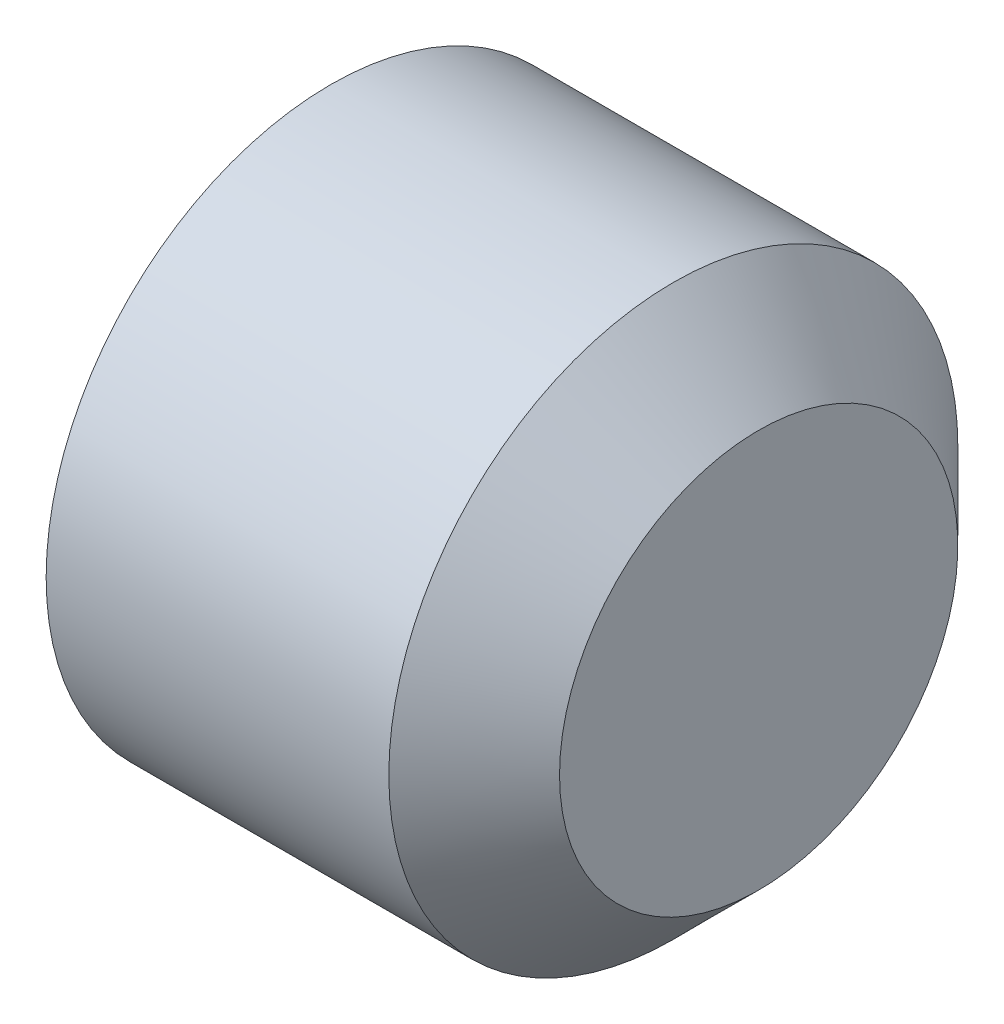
ISO-10303-21;
HEADER;
FILE_DESCRIPTION(('STEP AP214'),'2;1');
FILE_NAME('part.step','',(''),(''),'','','');
FILE_SCHEMA(('AUTOMOTIVE_DESIGN { 1 0 10303 214 1 1 1 1 }'));
ENDSEC;
DATA;
#1=APPLICATION_CONTEXT('core data for automotive mechanical design processes');
#2=APPLICATION_PROTOCOL_DEFINITION('international standard','automotive_design',2000,#1);
#3=PRODUCT_CONTEXT('',#1,'mechanical');
#4=PRODUCT('Part','Part','',(#3));
#5=PRODUCT_RELATED_PRODUCT_CATEGORY('part','',(#4));
#6=PRODUCT_DEFINITION_FORMATION('','',#4);
#7=PRODUCT_DEFINITION_CONTEXT('part definition',#1,'design');
#8=PRODUCT_DEFINITION('design','',#6,#7);
#9=PRODUCT_DEFINITION_SHAPE('','',#8);
#10=(LENGTH_UNIT() NAMED_UNIT(*) SI_UNIT(.MILLI.,.METRE.));
#11=(NAMED_UNIT(*) PLANE_ANGLE_UNIT() SI_UNIT($,.RADIAN.));
#12=(NAMED_UNIT(*) SI_UNIT($,.STERADIAN.) SOLID_ANGLE_UNIT());
#13=UNCERTAINTY_MEASURE_WITH_UNIT(LENGTH_MEASURE(1.E-05),#10,'distance_accuracy_value','');
#14=(GEOMETRIC_REPRESENTATION_CONTEXT(3) GLOBAL_UNCERTAINTY_ASSIGNED_CONTEXT((#13)) GLOBAL_UNIT_ASSIGNED_CONTEXT((#10,
#11,#12)) REPRESENTATION_CONTEXT('',''));
#15=CARTESIAN_POINT('',(0.,0.,0.));
#16=DIRECTION('',(0.,0.,1.));
#17=DIRECTION('',(1.,0.,0.));
#18=AXIS2_PLACEMENT_3D('',#15,#16,#17);
#19=CARTESIAN_POINT('',(0.,0.,0.));
#20=DIRECTION('',(-1.,0.,0.));
#21=DIRECTION('',(0.,0.,1.));
#22=AXIS2_PLACEMENT_3D('',#19,#20,#21);
#23=PLANE('',#22);
#24=CARTESIAN_POINT('',(0.,0.,0.));
#25=DIRECTION('',(-1.,0.,0.));
#26=DIRECTION('',(0.,0.,1.));
#27=AXIS2_PLACEMENT_3D('',#24,#25,#26);
#28=CIRCLE('',#27,4.172);
#29=CARTESIAN_POINT('',(0.,0.,4.172));
#30=VERTEX_POINT('',#29);
#31=EDGE_CURVE('E139',#30,#30,#28,.T.);
#32=ORIENTED_EDGE('',*,*,#31,.T.);
#33=EDGE_LOOP('',(#32));
#34=FACE_BOUND('',#33,.T.);
#35=DIRECTION('',(0.,0.,-1.));
#36=VECTOR('',#35,1.);
#37=CARTESIAN_POINT('',(0.,2.5,1.44337567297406));
#38=LINE('',#37,#36);
#39=CARTESIAN_POINT('',(0.,2.5,1.44337567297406));
#40=VERTEX_POINT('',#39);
#41=CARTESIAN_POINT('',(0.,2.5,-1.44337567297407));
#42=VERTEX_POINT('',#41);
#43=EDGE_CURVE('E130',#40,#42,#38,.T.);
#44=ORIENTED_EDGE('',*,*,#43,.F.);
#45=DIRECTION('',(0.,-0.866025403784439,0.5));
#46=VECTOR('',#45,1.);
#47=CARTESIAN_POINT('',(0.,2.5,1.44337567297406));
#48=LINE('',#47,#46);
#49=CARTESIAN_POINT('',(0.,0.,2.88675134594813));
#50=VERTEX_POINT('',#49);
#51=EDGE_CURVE('E52',#40,#50,#48,.T.);
#52=ORIENTED_EDGE('',*,*,#51,.T.);
#53=DIRECTION('',(0.,0.866025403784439,0.5));
#54=VECTOR('',#53,1.);
#55=CARTESIAN_POINT('',(0.,-2.5,1.44337567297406));
#56=LINE('',#55,#54);
#57=CARTESIAN_POINT('',(0.,-2.5,1.44337567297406));
#58=VERTEX_POINT('',#57);
#59=EDGE_CURVE('E121',#58,#50,#56,.T.);
#60=ORIENTED_EDGE('',*,*,#59,.F.);
#61=DIRECTION('',(0.,0.,-1.));
#62=VECTOR('',#61,1.);
#63=CARTESIAN_POINT('',(0.,-2.5,1.44337567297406));
#64=LINE('',#63,#62);
#65=CARTESIAN_POINT('',(0.,-2.5,-1.44337567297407));
#66=VERTEX_POINT('',#65);
#67=EDGE_CURVE('E124',#58,#66,#64,.T.);
#68=ORIENTED_EDGE('',*,*,#67,.T.);
#69=DIRECTION('',(0.,0.866025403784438,-0.5));
#70=VECTOR('',#69,1.);
#71=CARTESIAN_POINT('',(0.,-2.5,-1.44337567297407));
#72=LINE('',#71,#70);
#73=CARTESIAN_POINT('',(0.,0.,-2.88675134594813));
#74=VERTEX_POINT('',#73);
#75=EDGE_CURVE('E127',#66,#74,#72,.T.);
#76=ORIENTED_EDGE('',*,*,#75,.T.);
#77=DIRECTION('',(0.,-0.866025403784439,-0.5));
#78=VECTOR('',#77,1.);
#79=CARTESIAN_POINT('',(0.,2.5,-1.44337567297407));
#80=LINE('',#79,#78);
#81=EDGE_CURVE('E110',#42,#74,#80,.T.);
#82=ORIENTED_EDGE('',*,*,#81,.F.);
#83=EDGE_LOOP('',(#44,#52,#60,#68,#76,#82));
#84=FACE_BOUND('',#83,.T.);
#85=ADVANCED_FACE('F37',(#34,#84),#23,.T.);
#86=CARTESIAN_POINT('',(8.,3.5,0.));
#87=DIRECTION('',(1.,0.,0.));
#88=DIRECTION('',(0.,0.,-1.));
#89=AXIS2_PLACEMENT_3D('',#86,#87,#88);
#90=PLANE('',#89);
#91=CARTESIAN_POINT('',(8.,0.,0.));
#92=DIRECTION('',(-1.,0.,0.));
#93=DIRECTION('',(0.,0.,1.));
#94=AXIS2_PLACEMENT_3D('',#91,#92,#93);
#95=CIRCLE('',#94,3.5);
#96=CARTESIAN_POINT('',(8.,0.,3.5));
#97=VERTEX_POINT('',#96);
#98=EDGE_CURVE('E11',#97,#97,#95,.T.);
#99=ORIENTED_EDGE('',*,*,#98,.F.);
#100=EDGE_LOOP('',(#99));
#101=FACE_BOUND('',#100,.T.);
#102=ADVANCED_FACE('F39',(#101),#90,.T.);
#103=CARTESIAN_POINT('',(6.50000000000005,0.,0.));
#104=DIRECTION('',(-1.,0.,0.));
#105=DIRECTION('',(0.,0.,1.));
#106=AXIS2_PLACEMENT_3D('',#103,#104,#105);
#107=CONICAL_SURFACE('',#106,5.,0.785398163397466);
#108=ORIENTED_EDGE('',*,*,#98,.T.);
#109=EDGE_LOOP('',(#108));
#110=FACE_BOUND('',#109,.T.);
#111=CARTESIAN_POINT('',(6.50000000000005,0.,0.));
#112=DIRECTION('',(-1.,0.,0.));
#113=DIRECTION('',(0.,0.,1.));
#114=AXIS2_PLACEMENT_3D('',#111,#112,#113);
#115=CIRCLE('',#114,5.);
#116=CARTESIAN_POINT('',(6.50000000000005,0.,5.));
#117=VERTEX_POINT('',#116);
#118=EDGE_CURVE('E45',#117,#117,#115,.T.);
#119=ORIENTED_EDGE('',*,*,#118,.F.);
#120=EDGE_LOOP('',(#119));
#121=FACE_BOUND('',#120,.T.);
#122=ADVANCED_FACE('F150',(#110,#121),#107,.T.);
#123=CARTESIAN_POINT('',(-12.7,0.,0.));
#124=DIRECTION('',(-1.,0.,0.));
#125=DIRECTION('',(0.,0.,1.));
#126=AXIS2_PLACEMENT_3D('',#123,#124,#125);
#127=CYLINDRICAL_SURFACE('',#126,5.);
#128=ORIENTED_EDGE('',*,*,#118,.T.);
#129=EDGE_LOOP('',(#128));
#130=FACE_BOUND('',#129,.T.);
#131=CARTESIAN_POINT('',(0.478046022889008,0.,0.));
#132=DIRECTION('',(-1.,0.,0.));
#133=DIRECTION('',(0.,0.,1.));
#134=AXIS2_PLACEMENT_3D('',#131,#132,#133);
#135=CIRCLE('',#134,5.);
#136=CARTESIAN_POINT('',(0.478046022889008,0.,5.));
#137=VERTEX_POINT('',#136);
#138=EDGE_CURVE('E142',#137,#137,#135,.T.);
#139=ORIENTED_EDGE('',*,*,#138,.F.);
#140=EDGE_LOOP('',(#139));
#141=FACE_BOUND('',#140,.T.);
#142=ADVANCED_FACE('F147',(#130,#141),#127,.T.);
#143=CARTESIAN_POINT('',(0.,0.,0.));
#144=DIRECTION('',(1.,0.,0.));
#145=DIRECTION('',(0.,0.,-1.));
#146=AXIS2_PLACEMENT_3D('',#143,#144,#145);
#147=CONICAL_SURFACE('',#146,4.172,1.0471975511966);
#148=ORIENTED_EDGE('',*,*,#138,.T.);
#149=EDGE_LOOP('',(#148));
#150=FACE_BOUND('',#149,.T.);
#151=ORIENTED_EDGE('',*,*,#31,.F.);
#152=EDGE_LOOP('',(#151));
#153=FACE_BOUND('',#152,.T.);
#154=ADVANCED_FACE('F157',(#150,#153),#147,.T.);
#155=CARTESIAN_POINT('',(4.,2.5,1.44337567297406));
#156=DIRECTION('',(0.,-0.5,-0.866025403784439));
#157=DIRECTION('',(0.,0.866025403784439,-0.5));
#158=AXIS2_PLACEMENT_3D('',#155,#156,#157);
#159=PLANE('',#158);
#160=ORIENTED_EDGE('',*,*,#51,.F.);
#161=DIRECTION('',(-1.,0.,0.));
#162=VECTOR('',#161,1.);
#163=CARTESIAN_POINT('',(4.,2.5,1.44337567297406));
#164=LINE('',#163,#162);
#165=CARTESIAN_POINT('',(4.,2.5,1.44337567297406));
#166=VERTEX_POINT('',#165);
#167=EDGE_CURVE('E57',#166,#40,#164,.T.);
#168=ORIENTED_EDGE('',*,*,#167,.F.);
#169=DIRECTION('',(0.,-0.866025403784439,0.5));
#170=VECTOR('',#169,1.);
#171=CARTESIAN_POINT('',(4.,2.5,1.44337567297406));
#172=LINE('',#171,#170);
#173=CARTESIAN_POINT('',(4.,0.,2.88675134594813));
#174=VERTEX_POINT('',#173);
#175=EDGE_CURVE('E84',#166,#174,#172,.T.);
#176=ORIENTED_EDGE('',*,*,#175,.T.);
#177=DIRECTION('',(-1.,0.,0.));
#178=VECTOR('',#177,1.);
#179=CARTESIAN_POINT('',(4.,0.,2.88675134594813));
#180=LINE('',#179,#178);
#181=EDGE_CURVE('E137',#174,#50,#180,.T.);
#182=ORIENTED_EDGE('',*,*,#181,.T.);
#183=EDGE_LOOP('',(#160,#168,#176,#182));
#184=FACE_BOUND('',#183,.T.);
#185=ADVANCED_FACE('F168',(#184),#159,.T.);
#186=CARTESIAN_POINT('',(4.,-2.5,1.44337567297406));
#187=DIRECTION('',(0.,-0.5,0.866025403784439));
#188=DIRECTION('',(0.,-0.866025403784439,-0.5));
#189=AXIS2_PLACEMENT_3D('',#186,#187,#188);
#190=PLANE('',#189);
#191=ORIENTED_EDGE('',*,*,#59,.T.);
#192=ORIENTED_EDGE('',*,*,#181,.F.);
#193=DIRECTION('',(0.,0.866025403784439,0.5));
#194=VECTOR('',#193,1.);
#195=CARTESIAN_POINT('',(4.,-2.5,1.44337567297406));
#196=LINE('',#195,#194);
#197=CARTESIAN_POINT('',(4.,-2.5,1.44337567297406));
#198=VERTEX_POINT('',#197);
#199=EDGE_CURVE('E266',#198,#174,#196,.T.);
#200=ORIENTED_EDGE('',*,*,#199,.F.);
#201=DIRECTION('',(-1.,0.,0.));
#202=VECTOR('',#201,1.);
#203=CARTESIAN_POINT('',(4.,-2.5,1.44337567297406));
#204=LINE('',#203,#202);
#205=EDGE_CURVE('E135',#198,#58,#204,.T.);
#206=ORIENTED_EDGE('',*,*,#205,.T.);
#207=EDGE_LOOP('',(#191,#192,#200,#206));
#208=FACE_BOUND('',#207,.T.);
#209=ADVANCED_FACE('F175',(#208),#190,.F.);
#210=CARTESIAN_POINT('',(4.,-2.5,1.44337567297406));
#211=DIRECTION('',(0.,1.,0.));
#212=DIRECTION('',(0.,0.,1.));
#213=AXIS2_PLACEMENT_3D('',#210,#211,#212);
#214=PLANE('',#213);
#215=ORIENTED_EDGE('',*,*,#67,.F.);
#216=ORIENTED_EDGE('',*,*,#205,.F.);
#217=DIRECTION('',(0.,0.,-1.));
#218=VECTOR('',#217,1.);
#219=CARTESIAN_POINT('',(4.,-2.5,1.44337567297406));
#220=LINE('',#219,#218);
#221=CARTESIAN_POINT('',(4.,-2.5,-1.44337567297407));
#222=VERTEX_POINT('',#221);
#223=EDGE_CURVE('E105',#198,#222,#220,.T.);
#224=ORIENTED_EDGE('',*,*,#223,.T.);
#225=DIRECTION('',(-1.,0.,0.));
#226=VECTOR('',#225,1.);
#227=CARTESIAN_POINT('',(4.,-2.5,-1.44337567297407));
#228=LINE('',#227,#226);
#229=EDGE_CURVE('E100',#222,#66,#228,.T.);
#230=ORIENTED_EDGE('',*,*,#229,.T.);
#231=EDGE_LOOP('',(#215,#216,#224,#230));
#232=FACE_BOUND('',#231,.T.);
#233=ADVANCED_FACE('F182',(#232),#214,.T.);
#234=CARTESIAN_POINT('',(4.,-2.5,-1.44337567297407));
#235=DIRECTION('',(0.,0.5,0.866025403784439));
#236=DIRECTION('',(0.,-0.866025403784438,0.5));
#237=AXIS2_PLACEMENT_3D('',#234,#235,#236);
#238=PLANE('',#237);
#239=ORIENTED_EDGE('',*,*,#75,.F.);
#240=ORIENTED_EDGE('',*,*,#229,.F.);
#241=DIRECTION('',(0.,0.866025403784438,-0.5));
#242=VECTOR('',#241,1.);
#243=CARTESIAN_POINT('',(4.,-2.5,-1.44337567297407));
#244=LINE('',#243,#242);
#245=CARTESIAN_POINT('',(4.,0.,-2.88675134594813));
#246=VERTEX_POINT('',#245);
#247=EDGE_CURVE('E95',#222,#246,#244,.T.);
#248=ORIENTED_EDGE('',*,*,#247,.T.);
#249=DIRECTION('',(-1.,0.,0.));
#250=VECTOR('',#249,1.);
#251=CARTESIAN_POINT('',(4.,0.,-2.88675134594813));
#252=LINE('',#251,#250);
#253=EDGE_CURVE('E99',#246,#74,#252,.T.);
#254=ORIENTED_EDGE('',*,*,#253,.T.);
#255=EDGE_LOOP('',(#239,#240,#248,#254));
#256=FACE_BOUND('',#255,.T.);
#257=ADVANCED_FACE('F98',(#256),#238,.T.);
#258=CARTESIAN_POINT('',(4.,2.5,-1.44337567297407));
#259=DIRECTION('',(0.,0.5,-0.866025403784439));
#260=DIRECTION('',(0.,0.866025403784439,0.5));
#261=AXIS2_PLACEMENT_3D('',#258,#259,#260);
#262=PLANE('',#261);
#263=ORIENTED_EDGE('',*,*,#81,.T.);
#264=ORIENTED_EDGE('',*,*,#253,.F.);
#265=DIRECTION('',(0.,-0.866025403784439,-0.5));
#266=VECTOR('',#265,1.);
#267=CARTESIAN_POINT('',(4.,2.5,-1.44337567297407));
#268=LINE('',#267,#266);
#269=CARTESIAN_POINT('',(4.,2.5,-1.44337567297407));
#270=VERTEX_POINT('',#269);
#271=EDGE_CURVE('E104',#270,#246,#268,.T.);
#272=ORIENTED_EDGE('',*,*,#271,.F.);
#273=DIRECTION('',(-1.,0.,0.));
#274=VECTOR('',#273,1.);
#275=CARTESIAN_POINT('',(4.,2.5,-1.44337567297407));
#276=LINE('',#275,#274);
#277=EDGE_CURVE('E80',#270,#42,#276,.T.);
#278=ORIENTED_EDGE('',*,*,#277,.T.);
#279=EDGE_LOOP('',(#263,#264,#272,#278));
#280=FACE_BOUND('',#279,.T.);
#281=ADVANCED_FACE('F107',(#280),#262,.F.);
#282=CARTESIAN_POINT('',(4.,2.5,1.44337567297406));
#283=DIRECTION('',(0.,1.,0.));
#284=DIRECTION('',(0.,0.,1.));
#285=AXIS2_PLACEMENT_3D('',#282,#283,#284);
#286=PLANE('',#285);
#287=ORIENTED_EDGE('',*,*,#43,.T.);
#288=ORIENTED_EDGE('',*,*,#277,.F.);
#289=DIRECTION('',(0.,0.,-1.));
#290=VECTOR('',#289,1.);
#291=CARTESIAN_POINT('',(4.,2.5,1.44337567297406));
#292=LINE('',#291,#290);
#293=EDGE_CURVE('E115',#166,#270,#292,.T.);
#294=ORIENTED_EDGE('',*,*,#293,.F.);
#295=ORIENTED_EDGE('',*,*,#167,.T.);
#296=EDGE_LOOP('',(#287,#288,#294,#295));
#297=FACE_BOUND('',#296,.T.);
#298=ADVANCED_FACE('F194',(#297),#286,.F.);
#299=CARTESIAN_POINT('',(4.,5.,0.));
#300=DIRECTION('',(1.,0.,0.));
#301=DIRECTION('',(0.,0.,-1.));
#302=AXIS2_PLACEMENT_3D('',#299,#300,#301);
#303=PLANE('',#302);
#304=ORIENTED_EDGE('',*,*,#175,.F.);
#305=ORIENTED_EDGE('',*,*,#293,.T.);
#306=ORIENTED_EDGE('',*,*,#271,.T.);
#307=ORIENTED_EDGE('',*,*,#247,.F.);
#308=ORIENTED_EDGE('',*,*,#223,.F.);
#309=ORIENTED_EDGE('',*,*,#199,.T.);
#310=EDGE_LOOP('',(#304,#305,#306,#307,#308,#309));
#311=FACE_BOUND('',#310,.T.);
#312=ADVANCED_FACE('F113',(#311),#303,.F.);
#313=CLOSED_SHELL('',(#85,#102,#122,#142,#154,#185,#209,#233,#257,#281,#298,#312));
#314=MANIFOLD_SOLID_BREP('B2',#313);
#315=ADVANCED_BREP_SHAPE_REPRESENTATION('',(#18,#314),#14);
#316=SHAPE_DEFINITION_REPRESENTATION(#9,#315);
ENDSEC;
END-ISO-10303-21;
